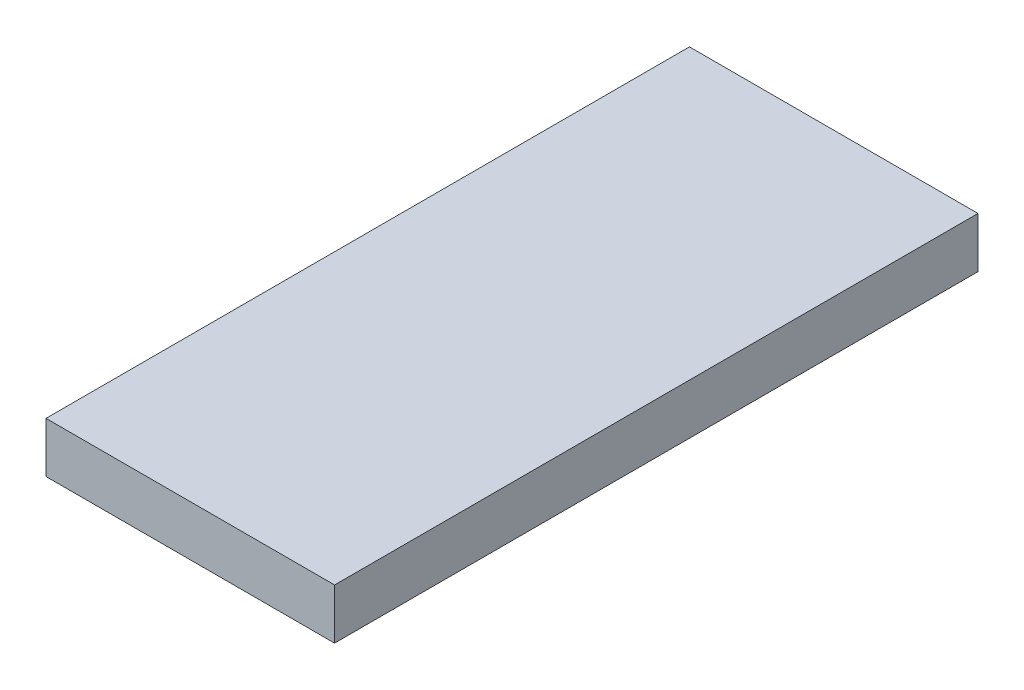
from build123d import *

# Parameters (mm, degrees)
SKETCH3_W           = 290.82
SKETCH3_H           = 648.5
BOSS_EXTRUDE1_DEPTH = 50.8


with BuildPart() as part:
    # Sketch3 → Boss-Extrude1 (new body)
    with BuildSketch(Plane(origin=(0, 0, 0), x_dir=(-1, 0, 0), z_dir=(0, 1, 0))):
        Rectangle(SKETCH3_W, SKETCH3_H)
    extrude(amount=BOSS_EXTRUDE1_DEPTH)


solid = part.part
